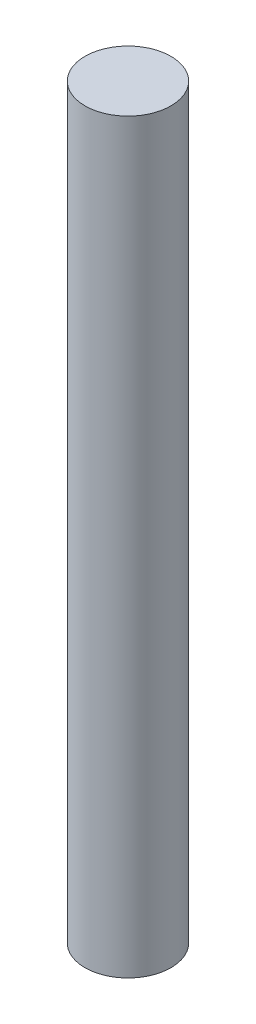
from build123d import *

# Parameters (mm, degrees)
SKETCH1_R           = 12.7
BOSS_EXTRUDE1_DEPTH = 220.6625


with BuildPart() as part:
    # Sketch1 → Boss-Extrude1 (new body)
    with BuildSketch(Plane(origin=(0, 0, 0), x_dir=(1, 0, 0), z_dir=(0, 1, 0))):
        with Locations(Location((0, 0, 0), (0, 0, 270))):
            Circle(SKETCH1_R)
    extrude(amount=BOSS_EXTRUDE1_DEPTH)


solid = part.part
